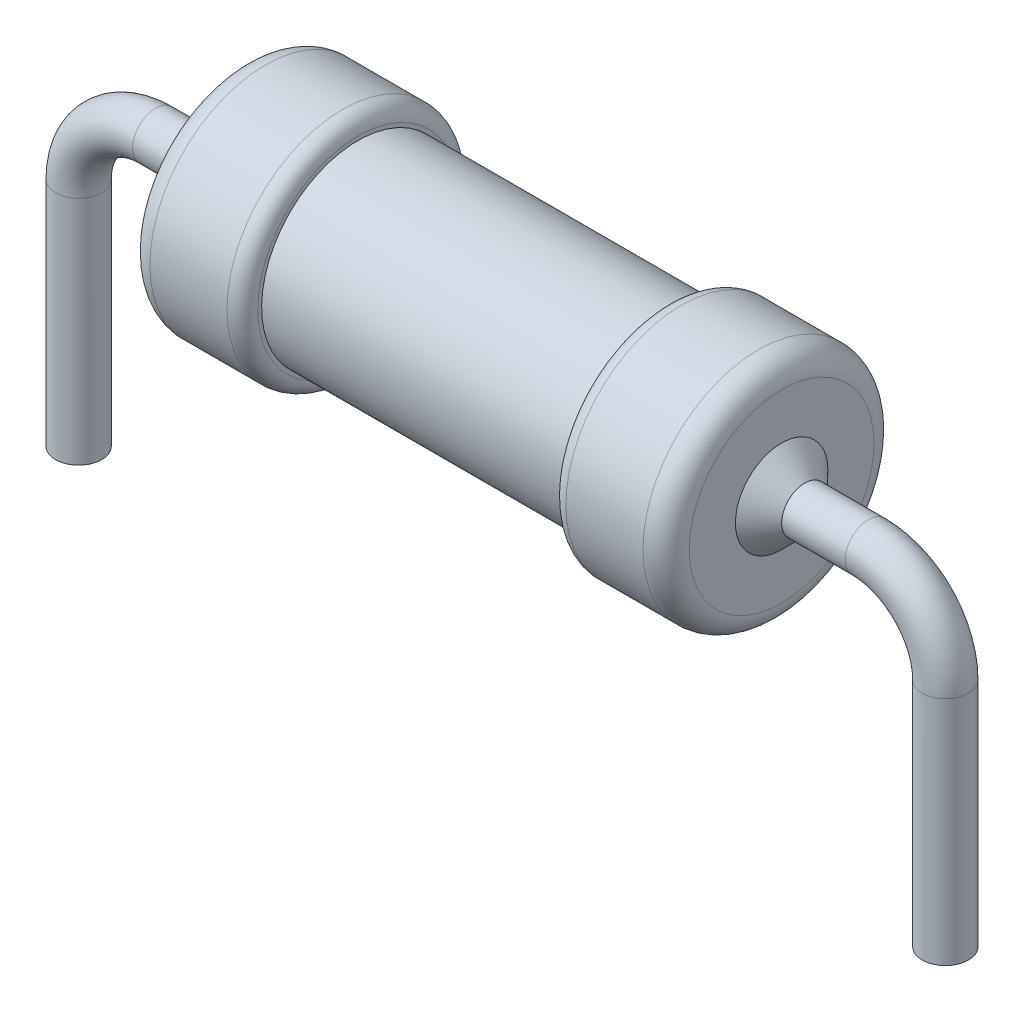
from build123d import *

# Parameters (mm, degrees)
SKETCH_3_R = 0.3
SKETCH_5_R = 0.3


with BuildPart() as part:
    # Sketch 1 → Revolve 1 (revolve)
    with BuildSketch(Plane.XY, mode=Mode.PRIVATE) as revolve_1_sk:
        with BuildLine():
            Line((-3.8, 1.5), (-3.8, 1.8))
            Line((-3.8, 1.8), (-3.5, 2.1))
            Line((-3.5, 2.1), (-3.5, 2.7))
            ThreePointArc((-3.5, 2.7), (-3.412132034, 2.912132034), (-3.2, 3))
            Line((-3.2, 3), (-2.2, 3))
            ThreePointArc((-2.2, 3), (-2.058578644, 2.941421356), (-2, 2.8))
            Line((-2, 2.8), (-2, 2.75))
            Line((-2, 2.75), (2, 2.75))
            Line((2, 2.75), (2, 2.8))
            ThreePointArc((2, 2.8), (2.058578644, 2.941421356), (2.2, 3))
            Line((2.2, 3), (3.2, 3))
            ThreePointArc((3.2, 3), (3.412132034, 2.912132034), (3.5, 2.7))
            Line((3.5, 2.7), (3.5, 2.1))
            Line((3.5, 2.1), (3.8, 1.8))
            Line((3.8, 1.8), (3.8, 1.5))
            Line((3.8, 1.5), (-3.8, 1.5))
        make_face()
    revolve(revolve_1_sk.sketch.rotate(Axis((-3.8, 1.5, 0), (1, 0, 0)), 180), axis=Axis((-3.8, 1.5, 0), (1, 0, 0)))

    # Sweep 1: sweep along a path in Sketch 2
    with BuildLine(Plane.XY) as sweep_1_path:
        Line((-3.8, 1.5), (-4.625, 1.5))
        ThreePointArc((-4.625, 1.5), (-5.332106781, 1.207106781), (-5.625, 0.5))
        Line((-5.625, 0.5), (-5.625, -2.5))
    # Sketch 3 → Sweep 1 (sweep)
    with BuildSketch(Plane.ZY.offset(3.8)):
        with Locations((0, 1.5)):
            Circle(SKETCH_3_R)
    sweep(path=sweep_1_path.line)

    # Sweep 2: sweep along a path in Sketch 4
    with BuildLine(Plane.XY) as sweep_2_path:
        Line((3.8, 1.5), (4.625, 1.5))
        ThreePointArc((4.625, 1.5), (5.332106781, 1.207106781), (5.625, 0.5))
        Line((5.625, 0.5), (5.625, -2.5))
    # Sketch 5 → Sweep 2 (sweep)
    with BuildSketch(Plane(origin=(3.8, 0, 0), x_dir=(0, 0, -1), z_dir=(1, 0, 0))):
        with Locations((0, 1.5)):
            Circle(SKETCH_5_R)
    sweep(path=sweep_2_path.line)


solid = part.part
